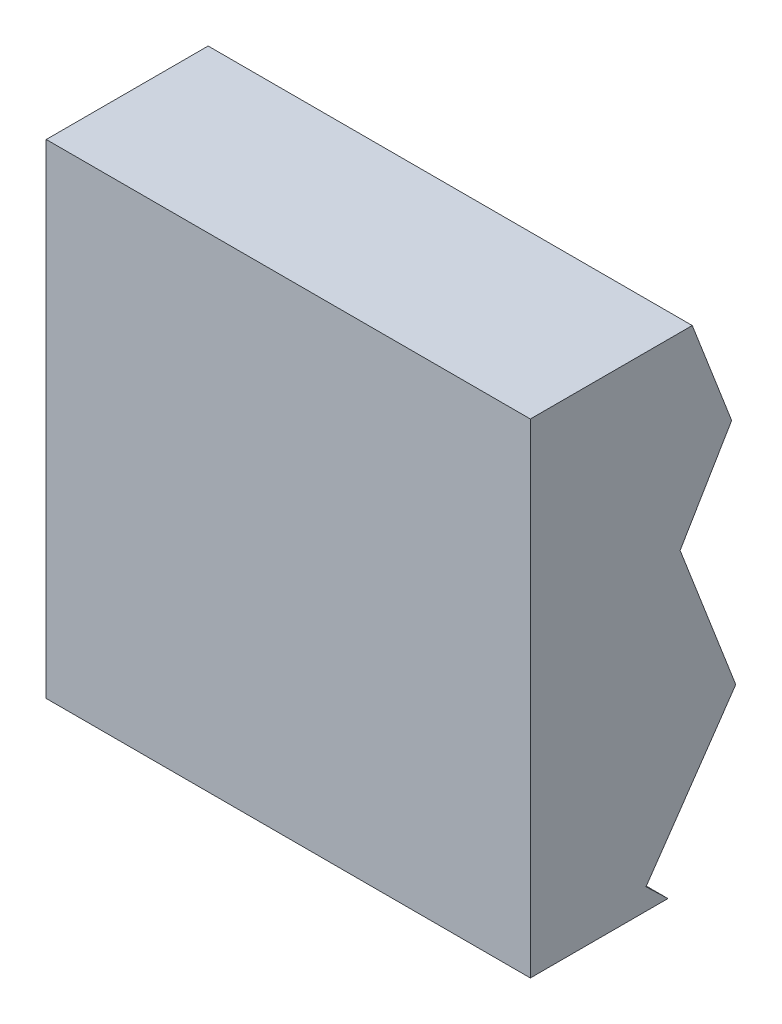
from build123d import *

# Parameters (mm, degrees)
SKIZZE1_W                       = 100
SKIZZE1_H                       = 100
AUFSATZ_LINEAR_AUSTRAGEN1_DEPTH = 100
WANDUNG1_T                      = -1
SCHNITT_LINEAR_AUSTRAGEN1_DEPTH = 151


with BuildPart() as part:
    # Skizze1 → Aufsatz-Linear austragen1 (new body)
    with BuildSketch(Plane.XY):
        Rectangle(SKIZZE1_W, SKIZZE1_H)
    extrude(amount=AUFSATZ_LINEAR_AUSTRAGEN1_DEPTH)

    # Wandung1
    wandung1_openings = [part.faces().sort_by_distance(p)[0] for p in [
        (0, 0, 0),
    ]]
    offset(amount=WANDUNG1_T, openings=wandung1_openings, kind=Kind.INTERSECTION)

    # Skizze2 → Schnitt-Linear austragen1 (cut, through all)
    with BuildSketch(Plane(origin=(50, 0, 0), x_dir=(0, 0, -1), z_dir=(1, 0, 0))):
        Polygon((-66.559149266, 50), (-58.421018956, 28.946510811), (-69.06662017, 11.014676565), (-57.572146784, -18.721732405), (-76.109581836, -45.624283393), (-71.574587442, -50), (0, -50), (0, 50), align=None)
    extrude(amount=-SCHNITT_LINEAR_AUSTRAGEN1_DEPTH, mode=Mode.SUBTRACT)


solid = part.part
